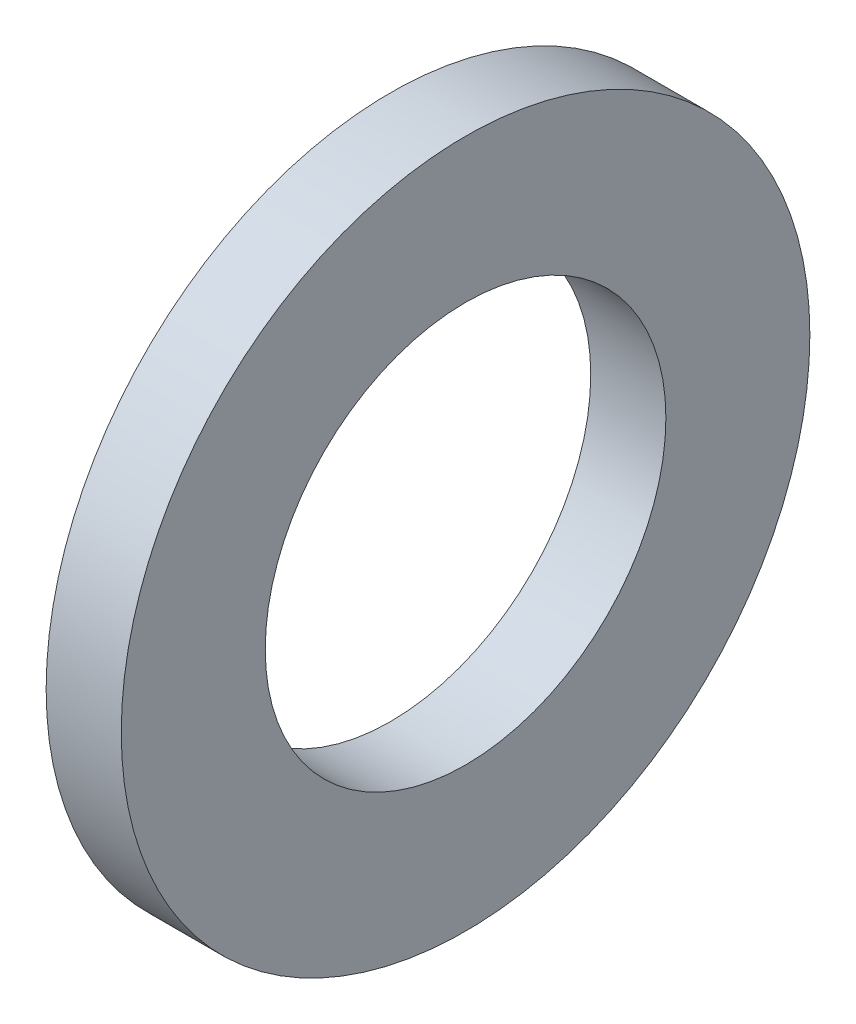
from build123d import *

# Parameters (mm, degrees)
ESQUISSE1_W = 1.2
ESQUISSE1_H = 2.3


with BuildPart() as part:
    # Esquisse1 → Base-R_volution (revolve)
    with BuildSketch(Plane(origin=(0, 0, 0), x_dir=(1, 0, 0), z_dir=(0, 1, 0)), mode=Mode.PRIVATE) as base_r_volution_sk:
        with Locations((0.6, 4.35)):
            Rectangle(ESQUISSE1_W, ESQUISSE1_H)
    revolve(base_r_volution_sk.sketch.rotate(Axis((0, 0, 0), (1, 0, 0)), 180), axis=Axis((0, 0, 0), (1, 0, 0)))


solid = part.part
